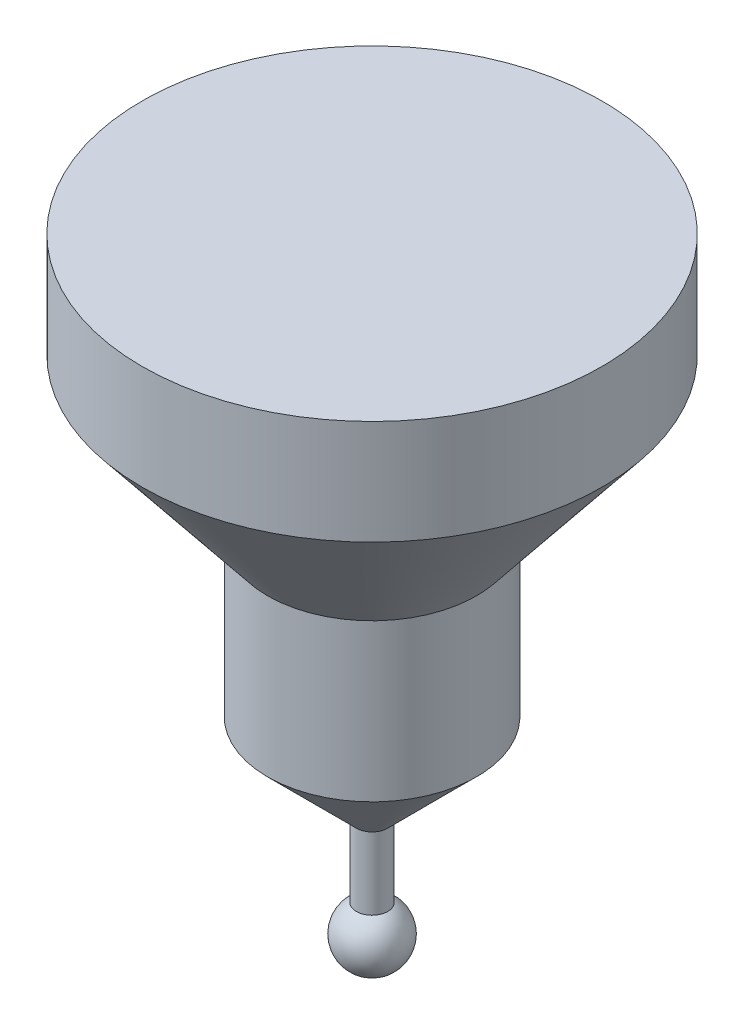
from build123d import *


with BuildPart() as part:
    # Skizze1 → Rotation1 (revolve)
    with BuildSketch(Plane.XY, mode=Mode.PRIVATE) as rotation1_sk:
        with BuildLine():
            Line((0, 58), (22, 58))
            Line((22, 58), (22, 48))
            Line((22, 48), (10, 33))
            Line((10, 33), (10, 18))
            Line((10, 18), (1.5, 9.5))
            Line((1.5, 9.5), (1.5, 2.598076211))
            ThreePointArc((1.5, 2.598076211), (2.897777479, -0.776457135), (0, -3))
            Line((0, -3), (0, 58))
        make_face()
    revolve(rotation1_sk.sketch.rotate(Axis((0, 67.243831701, 0), (0, -1, 0)), 90), axis=Axis((0, 67.243831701, 0), (0, -1, 0)))


solid = part.part
